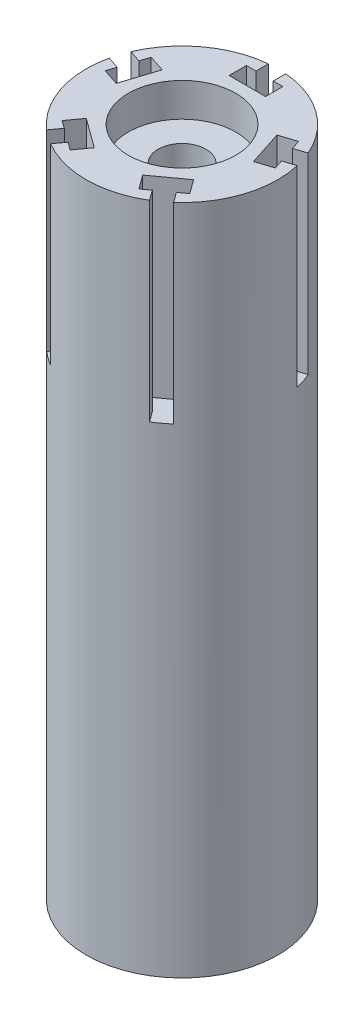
from build123d import *

# Parameters (mm, degrees)
SKETCH1_R               = 20
BOSS_EXTRUDE1_DEPTH     = 140
CUT_EXTRUDE1_START      = -40
CUT_EXTRUDE1_DEPTH      = 40
CIRPATTERN1_COUNT       = 5
SKETCH6_R               = 11.2
CUT_EXTRUDE2_DEPTH      = 7
CUT_EXTRUDE3_DEPTH      = 136.97426227
CUT_EXTRUDE3_DEPTH_BACK = 136.97426227
SKETCH8_R               = 5
CUT_EXTRUDE4_START      = -7
SKETCH9_R               = 11.2
CUT_EXTRUDE4_DEPTH      = 7


with BuildPart() as part:
    # Sketch1 → Boss-Extrude1 (new body)
    with BuildSketch(Plane(origin=(0, 0, 0), x_dir=(1, 0, 0), z_dir=(0, 1, 0))):
        with Locations(Location((0, 0, 0), (0, 0, 270))):
            Circle(SKETCH1_R)
    extrude(amount=BOSS_EXTRUDE1_DEPTH)

    # Sketch7 → Cut-Extrude1 (cut)
    with BuildSketch(Plane(origin=(0, 140, 0), x_dir=(1, 0, 0), z_dir=(0, 1, 0)).offset(CUT_EXTRUDE1_START)):
        with BuildLine():
            Line((1.7, 17.309545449), (3.7, 17.309545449))
            Line((3.7, 17.309545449), (3.7, 13.709545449))
            Line((3.7, 13.709545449), (-3.9, 13.709545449))
            Line((-3.9, 13.709545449), (-3.9, 17.309545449))
            Line((-3.9, 17.309545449), (-1.9, 17.309545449))
            Line((-1.9, 17.309545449), (-1.9, 19.909545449))
            ThreePointArc((-1.9, 19.909545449), (-0.100407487, 19.999747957), (1.7, 19.927619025))
            Line((1.7, 19.927619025), (1.7, 17.309545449))
        make_face()
    cut_extrude1 = extrude(amount=CUT_EXTRUDE1_DEPTH, mode=Mode.SUBTRACT)

    # CirPattern1: Cut-Extrude1 ×5 about axis
    cirpattern1_axis = Axis((0, 0, 0), (0, 1, 0))
    for i in range(1, CIRPATTERN1_COUNT):
        add(cut_extrude1.rotate(cirpattern1_axis, i * 360 / CIRPATTERN1_COUNT), mode=Mode.SUBTRACT)

    # Sketch6 → Cut-Extrude2 (cut)
    with BuildSketch(Plane.XZ):
        with Locations(Location((0, 0, 0), (0, 0, 270))):
            Circle(SKETCH6_R)
    extrude(amount=-CUT_EXTRUDE2_DEPTH, mode=Mode.SUBTRACT)

    # Sketch8 → Cut-Extrude3 (cut, two sides: drawn at the far end of the back side and taken through both)
    with BuildSketch(Plane.XZ.offset(-7).offset(-CUT_EXTRUDE3_DEPTH_BACK)):
        with Locations(Location((0, 0, 0), (0, 0, 270))):
            Circle(SKETCH8_R)
    extrude(amount=CUT_EXTRUDE3_DEPTH + CUT_EXTRUDE3_DEPTH_BACK, mode=Mode.SUBTRACT)

    # Sketch9 → Cut-Extrude4 (cut)
    with BuildSketch(Plane(origin=(0, 140, 0), x_dir=(1, 0, 0), z_dir=(0, 1, 0)).offset(CUT_EXTRUDE4_START)):
        with Locations(Location((0, 0, 0), (0, 0, 90))):
            Circle(SKETCH9_R)
    extrude(amount=CUT_EXTRUDE4_DEPTH, mode=Mode.SUBTRACT)


solid = part.part
